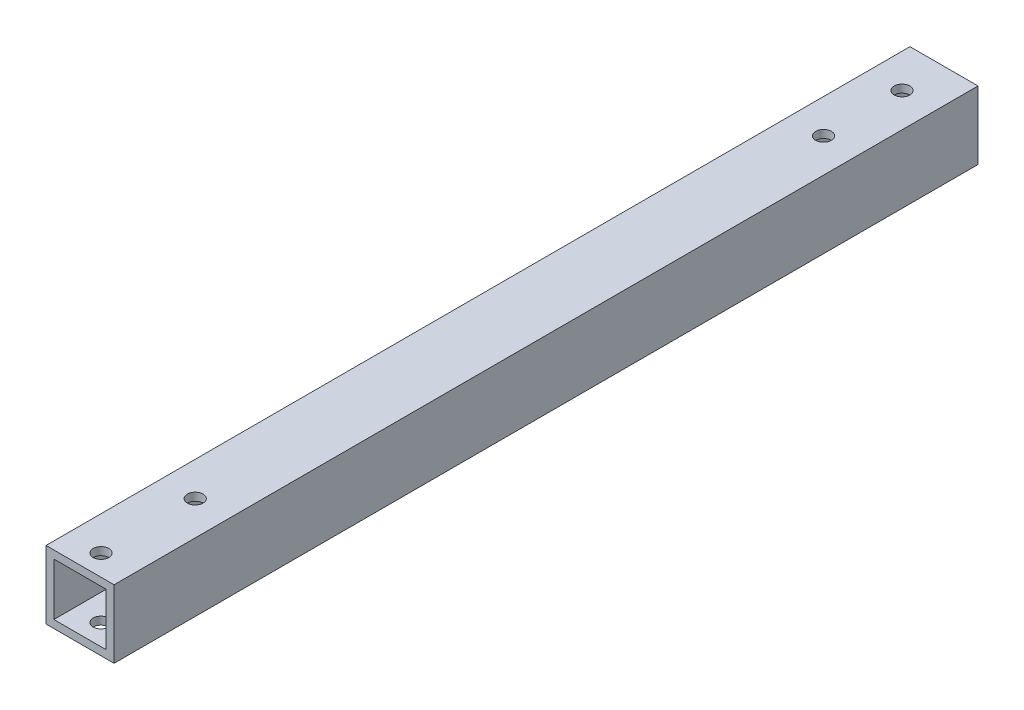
from build123d import *

# Parameters (mm, degrees)
SKETCH_1_W          = 13
SKETCH_1_H          = 13
EXTRUDE_1_DEPTH     = 165
SHELL_1_T           = -1.5
SKETCH_2_R          = 1.5
CUT_EXTRUDE_1_DEPTH = 166.63891451


with BuildPart() as part:
    # Sketch 1 → Extrude 1 (new body)
    with BuildSketch(Plane.XY):
        Rectangle(SKETCH_1_W, SKETCH_1_H)
    extrude(amount=EXTRUDE_1_DEPTH)

    # Shell 1
    shell_1_openings = [part.faces().sort_by_distance(p)[0] for p in [
        (0, 0, 165),
        (0, 0, 0),
    ]]
    offset(amount=SHELL_1_T, openings=shell_1_openings, kind=Kind.INTERSECTION)

    # Sketch 2 → Cut-Extrude 1 (cut, through all)
    with BuildSketch(Plane(origin=(0, 6.5, 0), x_dir=(1, 0, 0), z_dir=(0, 1, 0))):
        with Locations(Location((0, -8, 0), (0, 0, 270))):
            Circle(SKETCH_2_R)
        with Locations(Location((0, -23, 0), (0, 0, 270))):
            Circle(SKETCH_2_R)
        with Locations(Location((0, -161, 0), (0, 0, 270))):
            Circle(SKETCH_2_R)
        with Locations(Location((0, -143, 0), (0, 0, 270))):
            Circle(SKETCH_2_R)
    extrude(amount=-CUT_EXTRUDE_1_DEPTH, mode=Mode.SUBTRACT)


solid = part.part
